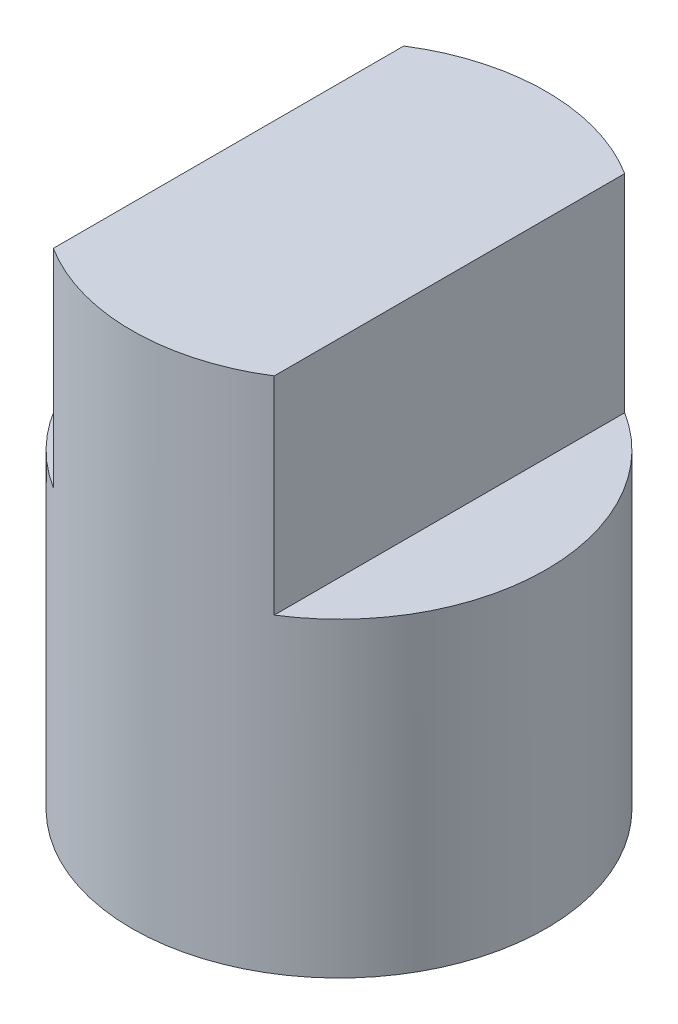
from build123d import *

# Parameters (mm, degrees)
SKETCH_1_R          = 30
EXTRUDE_1_DEPTH     = 75
CUT_EXTRUDE_START   = -30
CUT_EXTRUDE_1_DEPTH = 30


with BuildPart() as part:
    # Sketch 1 → Extrude 1 (new body)
    with BuildSketch(Plane(origin=(0, 0, 0), x_dir=(1, 0, 0), z_dir=(0, 1, 0))):
        with Locations(Location((0, 0, 0), (0, 0, 270))):
            Circle(SKETCH_1_R)
    extrude(amount=EXTRUDE_1_DEPTH)

    # Sketch 2 → Cut-Extrude 1 (cut)
    with BuildSketch(Plane(origin=(0, 75, 0), x_dir=(1, 0, 0), z_dir=(0, 1, 0)).offset(CUT_EXTRUDE_START)):
        with BuildLine():
            Line((-16, -25.377155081), (-16, 25.377155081))
            ThreePointArc((-16, 25.377155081), (-30, 0), (-16, -25.377155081))
        make_face()
        with BuildLine():
            Line((16, 25.377155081), (16, -25.377155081))
            ThreePointArc((16, -25.377155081), (30, 0), (16, 25.377155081))
        make_face()
    extrude(amount=CUT_EXTRUDE_1_DEPTH, mode=Mode.SUBTRACT)


solid = part.part
